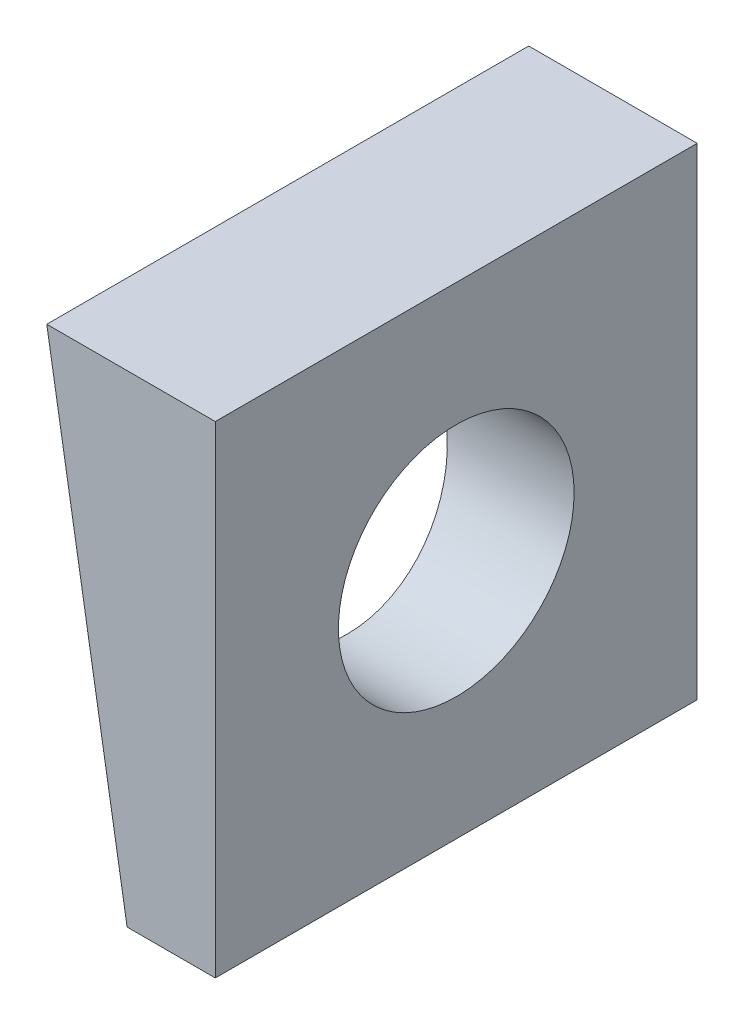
from build123d import *

# Parameters (mm, degrees)
BOSS_EXTRUDE1_DEPTH = 14.9225
SKETCH2_R           = 7.298703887
CUT_EXTRUDE1_DEPTH  = 24.54355317


with BuildPart() as part:
    # Sketch1 → Boss-Extrude1 (new, symmetric)
    with BuildSketch(Plane.XY):
        Polygon((-5.463116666, -14.9225), (0, -14.9225), (0, 14.9225), (-10.437283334, 14.9225), align=None)
    extrude(amount=BOSS_EXTRUDE1_DEPTH, both=True)

    # Sketch2 → Cut-Extrude1 (cut, through all)
    with BuildSketch(Plane(origin=(0, 0, 0), x_dir=(0, 0, -1), z_dir=(1, 0, 0))):
        Circle(SKETCH2_R)
    extrude(amount=-CUT_EXTRUDE1_DEPTH, mode=Mode.SUBTRACT)


solid = part.part
